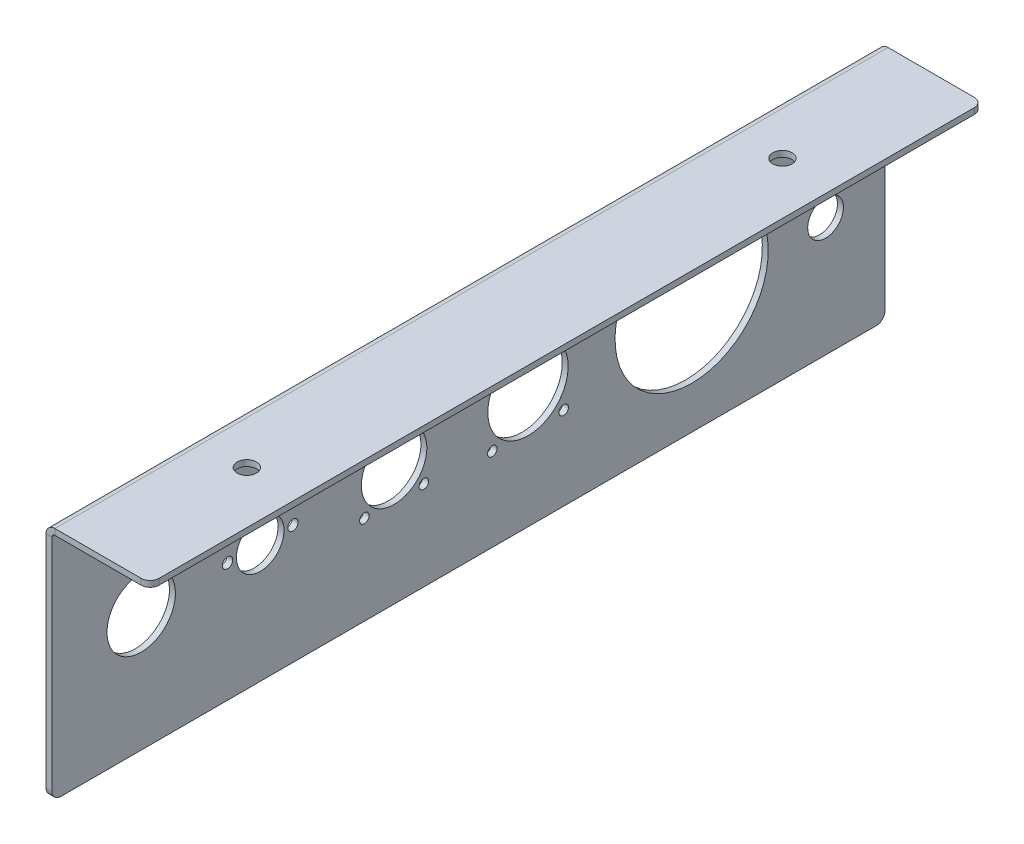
ISO-10303-21;
HEADER;
FILE_DESCRIPTION(('STEP AP214'),'2;1');
FILE_NAME('part.step','',(''),(''),'','','');
FILE_SCHEMA(('AUTOMOTIVE_DESIGN { 1 0 10303 214 1 1 1 1 }'));
ENDSEC;
DATA;
#1=APPLICATION_CONTEXT('core data for automotive mechanical design processes');
#2=APPLICATION_PROTOCOL_DEFINITION('international standard','automotive_design',2000,#1);
#3=PRODUCT_CONTEXT('',#1,'mechanical');
#4=PRODUCT('Part','Part','',(#3));
#5=PRODUCT_RELATED_PRODUCT_CATEGORY('part','',(#4));
#6=PRODUCT_DEFINITION_FORMATION('','',#4);
#7=PRODUCT_DEFINITION_CONTEXT('part definition',#1,'design');
#8=PRODUCT_DEFINITION('design','',#6,#7);
#9=PRODUCT_DEFINITION_SHAPE('','',#8);
#10=(LENGTH_UNIT() NAMED_UNIT(*) SI_UNIT(.MILLI.,.METRE.));
#11=(NAMED_UNIT(*) PLANE_ANGLE_UNIT() SI_UNIT($,.RADIAN.));
#12=(NAMED_UNIT(*) SI_UNIT($,.STERADIAN.) SOLID_ANGLE_UNIT());
#13=UNCERTAINTY_MEASURE_WITH_UNIT(LENGTH_MEASURE(1.E-05),#10,'distance_accuracy_value','');
#14=(GEOMETRIC_REPRESENTATION_CONTEXT(3) GLOBAL_UNCERTAINTY_ASSIGNED_CONTEXT((#13)) GLOBAL_UNIT_ASSIGNED_CONTEXT((#10,
#11,#12)) REPRESENTATION_CONTEXT('',''));
#15=CARTESIAN_POINT('',(0.,0.,0.));
#16=DIRECTION('',(0.,0.,1.));
#17=DIRECTION('',(1.,0.,0.));
#18=AXIS2_PLACEMENT_3D('',#15,#16,#17);
#19=CARTESIAN_POINT('',(17.5,-80.,90.));
#20=DIRECTION('',(0.,1.,0.));
#21=DIRECTION('',(0.,0.,1.));
#22=AXIS2_PLACEMENT_3D('',#19,#20,#21);
#23=CYLINDRICAL_SURFACE('',#22,3.25);
#24=CARTESIAN_POINT('',(17.5,-2.,90.));
#25=DIRECTION('',(0.,-1.,0.));
#26=DIRECTION('',(1.,0.,0.));
#27=AXIS2_PLACEMENT_3D('',#24,#25,#26);
#28=CIRCLE('',#27,3.25);
#29=CARTESIAN_POINT('',(20.75,-2.,90.));
#30=VERTEX_POINT('',#29);
#31=EDGE_CURVE('E240',#30,#30,#28,.T.);
#32=ORIENTED_EDGE('',*,*,#31,.T.);
#33=EDGE_LOOP('',(#32));
#34=FACE_BOUND('',#33,.T.);
#35=CARTESIAN_POINT('',(17.5,0.,90.));
#36=DIRECTION('',(0.,1.,0.));
#37=DIRECTION('',(0.,0.,1.));
#38=AXIS2_PLACEMENT_3D('',#35,#36,#37);
#39=CIRCLE('',#38,3.25);
#40=CARTESIAN_POINT('',(17.5,0.,93.25));
#41=VERTEX_POINT('',#40);
#42=EDGE_CURVE('E259',#41,#41,#39,.T.);
#43=ORIENTED_EDGE('',*,*,#42,.T.);
#44=EDGE_LOOP('',(#43));
#45=FACE_BOUND('',#44,.T.);
#46=ADVANCED_FACE('F28',(#34,#45),#23,.F.);
#47=CARTESIAN_POINT('',(0.,0.,140.));
#48=DIRECTION('',(0.,1.,0.));
#49=DIRECTION('',(0.,0.,1.));
#50=AXIS2_PLACEMENT_3D('',#47,#48,#49);
#51=PLANE('',#50);
#52=DIRECTION('',(0.,0.,-1.));
#53=VECTOR('',#52,1.);
#54=CARTESIAN_POINT('',(2.99999999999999,0.,-140.));
#55=LINE('',#54,#53);
#56=CARTESIAN_POINT('',(2.99999999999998,0.,140.));
#57=VERTEX_POINT('',#56);
#58=CARTESIAN_POINT('',(2.99999999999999,0.,-140.));
#59=VERTEX_POINT('',#58);
#60=EDGE_CURVE('E274',#57,#59,#55,.T.);
#61=ORIENTED_EDGE('',*,*,#60,.F.);
#62=DIRECTION('',(1.,0.,0.));
#63=VECTOR('',#62,1.);
#64=CARTESIAN_POINT('',(34.9999999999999,0.,140.));
#65=LINE('',#64,#63);
#66=CARTESIAN_POINT('',(32.,0.,140.));
#67=VERTEX_POINT('',#66);
#68=EDGE_CURVE('E11',#57,#67,#65,.T.);
#69=ORIENTED_EDGE('',*,*,#68,.T.);
#70=CARTESIAN_POINT('',(32.,0.,137.));
#71=DIRECTION('',(0.,1.,0.));
#72=DIRECTION('',(0.,0.,1.));
#73=AXIS2_PLACEMENT_3D('',#70,#71,#72);
#74=CIRCLE('',#73,3.);
#75=CARTESIAN_POINT('',(35.,0.,137.));
#76=VERTEX_POINT('',#75);
#77=EDGE_CURVE('E262',#67,#76,#74,.T.);
#78=ORIENTED_EDGE('',*,*,#77,.T.);
#79=DIRECTION('',(0.,0.,-1.));
#80=VECTOR('',#79,1.);
#81=CARTESIAN_POINT('',(35.,0.,140.));
#82=LINE('',#81,#80);
#83=CARTESIAN_POINT('',(35.,0.,-137.));
#84=VERTEX_POINT('',#83);
#85=EDGE_CURVE('E265',#76,#84,#82,.T.);
#86=ORIENTED_EDGE('',*,*,#85,.T.);
#87=CARTESIAN_POINT('',(32.,0.,-137.));
#88=DIRECTION('',(0.,1.,0.));
#89=DIRECTION('',(0.,0.,1.));
#90=AXIS2_PLACEMENT_3D('',#87,#88,#89);
#91=CIRCLE('',#90,3.);
#92=CARTESIAN_POINT('',(32.,0.,-140.));
#93=VERTEX_POINT('',#92);
#94=EDGE_CURVE('E268',#84,#93,#91,.T.);
#95=ORIENTED_EDGE('',*,*,#94,.T.);
#96=DIRECTION('',(1.,0.,0.));
#97=VECTOR('',#96,1.);
#98=CARTESIAN_POINT('',(0.,0.,-140.));
#99=LINE('',#98,#97);
#100=EDGE_CURVE('E51',#59,#93,#99,.T.);
#101=ORIENTED_EDGE('',*,*,#100,.F.);
#102=EDGE_LOOP('',(#61,#69,#78,#86,#95,#101));
#103=FACE_BOUND('',#102,.T.);
#104=CARTESIAN_POINT('',(17.5,0.,-90.));
#105=DIRECTION('',(0.,1.,0.));
#106=DIRECTION('',(0.,0.,1.));
#107=AXIS2_PLACEMENT_3D('',#104,#105,#106);
#108=CIRCLE('',#107,3.25);
#109=CARTESIAN_POINT('',(17.5,0.,-86.75));
#110=VERTEX_POINT('',#109);
#111=EDGE_CURVE('E256',#110,#110,#108,.T.);
#112=ORIENTED_EDGE('',*,*,#111,.F.);
#113=EDGE_LOOP('',(#112));
#114=FACE_BOUND('',#113,.T.);
#115=ORIENTED_EDGE('',*,*,#42,.F.);
#116=EDGE_LOOP('',(#115));
#117=FACE_BOUND('',#116,.T.);
#118=ADVANCED_FACE('F291',(#103,#114,#117),#51,.T.);
#119=CARTESIAN_POINT('',(17.5,-80.,-90.));
#120=DIRECTION('',(0.,1.,0.));
#121=DIRECTION('',(0.,0.,1.));
#122=AXIS2_PLACEMENT_3D('',#119,#120,#121);
#123=CYLINDRICAL_SURFACE('',#122,3.25);
#124=CARTESIAN_POINT('',(17.5,-2.,-90.));
#125=DIRECTION('',(0.,-1.,0.));
#126=DIRECTION('',(1.,0.,0.));
#127=AXIS2_PLACEMENT_3D('',#124,#125,#126);
#128=CIRCLE('',#127,3.25);
#129=CARTESIAN_POINT('',(20.75,-2.,-90.));
#130=VERTEX_POINT('',#129);
#131=EDGE_CURVE('E145',#130,#130,#128,.T.);
#132=ORIENTED_EDGE('',*,*,#131,.T.);
#133=EDGE_LOOP('',(#132));
#134=FACE_BOUND('',#133,.T.);
#135=ORIENTED_EDGE('',*,*,#111,.T.);
#136=EDGE_LOOP('',(#135));
#137=FACE_BOUND('',#136,.T.);
#138=ADVANCED_FACE('F391',(#134,#137),#123,.F.);
#139=CARTESIAN_POINT('',(35.,-2.,140.));
#140=DIRECTION('',(0.,-1.,0.));
#141=DIRECTION('',(1.,0.,0.));
#142=AXIS2_PLACEMENT_3D('',#139,#140,#141);
#143=PLANE('',#142);
#144=DIRECTION('',(0.,0.,1.));
#145=VECTOR('',#144,1.);
#146=CARTESIAN_POINT('',(2.99999999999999,-2.00000000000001,-140.));
#147=LINE('',#146,#145);
#148=CARTESIAN_POINT('',(2.99999999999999,-1.99999999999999,-140.));
#149=VERTEX_POINT('',#148);
#150=CARTESIAN_POINT('',(2.99999999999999,-1.99999999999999,140.));
#151=VERTEX_POINT('',#150);
#152=EDGE_CURVE('E272',#149,#151,#147,.T.);
#153=ORIENTED_EDGE('',*,*,#152,.F.);
#154=DIRECTION('',(-1.,0.,0.));
#155=VECTOR('',#154,1.);
#156=CARTESIAN_POINT('',(35.,-2.,-140.));
#157=LINE('',#156,#155);
#158=CARTESIAN_POINT('',(32.,-2.00000000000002,-140.));
#159=VERTEX_POINT('',#158);
#160=EDGE_CURVE('E251',#159,#149,#157,.T.);
#161=ORIENTED_EDGE('',*,*,#160,.F.);
#162=CARTESIAN_POINT('',(32.,-2.,-137.));
#163=DIRECTION('',(0.,-1.,0.));
#164=DIRECTION('',(1.,0.,0.));
#165=AXIS2_PLACEMENT_3D('',#162,#163,#164);
#166=CIRCLE('',#165,3.);
#167=CARTESIAN_POINT('',(35.,-2.00000000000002,-137.));
#168=VERTEX_POINT('',#167);
#169=EDGE_CURVE('E253',#159,#168,#166,.T.);
#170=ORIENTED_EDGE('',*,*,#169,.T.);
#171=DIRECTION('',(0.,0.,-1.));
#172=VECTOR('',#171,1.);
#173=CARTESIAN_POINT('',(35.,-2.,140.));
#174=LINE('',#173,#172);
#175=CARTESIAN_POINT('',(35.,-2.00000000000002,137.));
#176=VERTEX_POINT('',#175);
#177=EDGE_CURVE('E243',#176,#168,#174,.T.);
#178=ORIENTED_EDGE('',*,*,#177,.F.);
#179=CARTESIAN_POINT('',(32.,-2.,137.));
#180=DIRECTION('',(0.,-1.,0.));
#181=DIRECTION('',(1.,0.,0.));
#182=AXIS2_PLACEMENT_3D('',#179,#180,#181);
#183=CIRCLE('',#182,3.);
#184=CARTESIAN_POINT('',(32.,-2.00000000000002,140.));
#185=VERTEX_POINT('',#184);
#186=EDGE_CURVE('E245',#176,#185,#183,.T.);
#187=ORIENTED_EDGE('',*,*,#186,.T.);
#188=DIRECTION('',(-1.,0.,0.));
#189=VECTOR('',#188,1.);
#190=CARTESIAN_POINT('',(35.,-2.,140.));
#191=LINE('',#190,#189);
#192=EDGE_CURVE('E248',#185,#151,#191,.T.);
#193=ORIENTED_EDGE('',*,*,#192,.T.);
#194=EDGE_LOOP('',(#153,#161,#170,#178,#187,#193));
#195=FACE_BOUND('',#194,.T.);
#196=ORIENTED_EDGE('',*,*,#131,.F.);
#197=EDGE_LOOP('',(#196));
#198=FACE_BOUND('',#197,.T.);
#199=ORIENTED_EDGE('',*,*,#31,.F.);
#200=EDGE_LOOP('',(#199));
#201=FACE_BOUND('',#200,.T.);
#202=ADVANCED_FACE('F301',(#195,#198,#201),#143,.T.);
#203=CARTESIAN_POINT('',(34.9999999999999,-563.645278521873,-140.));
#204=DIRECTION('',(0.,0.,-1.));
#205=DIRECTION('',(0.,1.,0.));
#206=AXIS2_PLACEMENT_3D('',#203,#204,#205);
#207=PLANE('',#206);
#208=DIRECTION('',(0.,1.,0.));
#209=VECTOR('',#208,1.);
#210=CARTESIAN_POINT('',(2.99999999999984,-563.645278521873,-140.));
#211=LINE('',#210,#209);
#212=EDGE_CURVE('E36',#149,#59,#211,.T.);
#213=ORIENTED_EDGE('',*,*,#212,.T.);
#214=ORIENTED_EDGE('',*,*,#100,.T.);
#215=DIRECTION('',(0.,1.,0.));
#216=VECTOR('',#215,1.);
#217=CARTESIAN_POINT('',(31.9999999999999,-563.645278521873,-140.));
#218=LINE('',#217,#216);
#219=EDGE_CURVE('E286',#159,#93,#218,.T.);
#220=ORIENTED_EDGE('',*,*,#219,.F.);
#221=ORIENTED_EDGE('',*,*,#160,.T.);
#222=EDGE_LOOP('',(#213,#214,#220,#221));
#223=FACE_BOUND('',#222,.T.);
#224=ADVANCED_FACE('F30',(#223),#207,.T.);
#225=CARTESIAN_POINT('',(31.9999999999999,-563.645278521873,-137.));
#226=DIRECTION('',(0.,1.,0.));
#227=DIRECTION('',(-1.,0.,0.));
#228=AXIS2_PLACEMENT_3D('',#225,#226,#227);
#229=CYLINDRICAL_SURFACE('',#228,3.);
#230=ORIENTED_EDGE('',*,*,#94,.F.);
#231=DIRECTION('',(0.,1.,0.));
#232=VECTOR('',#231,1.);
#233=CARTESIAN_POINT('',(34.9999999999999,-563.645278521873,-137.));
#234=LINE('',#233,#232);
#235=EDGE_CURVE('E283',#168,#84,#234,.T.);
#236=ORIENTED_EDGE('',*,*,#235,.F.);
#237=ORIENTED_EDGE('',*,*,#169,.F.);
#238=ORIENTED_EDGE('',*,*,#219,.T.);
#239=EDGE_LOOP('',(#230,#236,#237,#238));
#240=FACE_BOUND('',#239,.T.);
#241=ADVANCED_FACE('F295',(#240),#229,.T.);
#242=CARTESIAN_POINT('',(34.9999999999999,-563.645278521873,140.));
#243=DIRECTION('',(1.,0.,0.));
#244=DIRECTION('',(0.,1.,0.));
#245=AXIS2_PLACEMENT_3D('',#242,#243,#244);
#246=PLANE('',#245);
#247=ORIENTED_EDGE('',*,*,#235,.T.);
#248=ORIENTED_EDGE('',*,*,#85,.F.);
#249=DIRECTION('',(0.,1.,0.));
#250=VECTOR('',#249,1.);
#251=CARTESIAN_POINT('',(34.9999999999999,-563.645278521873,137.));
#252=LINE('',#251,#250);
#253=EDGE_CURVE('E280',#176,#76,#252,.T.);
#254=ORIENTED_EDGE('',*,*,#253,.F.);
#255=ORIENTED_EDGE('',*,*,#177,.T.);
#256=EDGE_LOOP('',(#247,#248,#254,#255));
#257=FACE_BOUND('',#256,.T.);
#258=ADVANCED_FACE('F297',(#257),#246,.T.);
#259=CARTESIAN_POINT('',(31.9999999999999,-563.645278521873,137.));
#260=DIRECTION('',(0.,1.,0.));
#261=DIRECTION('',(-1.,0.,0.));
#262=AXIS2_PLACEMENT_3D('',#259,#260,#261);
#263=CYLINDRICAL_SURFACE('',#262,3.);
#264=ORIENTED_EDGE('',*,*,#77,.F.);
#265=DIRECTION('',(0.,1.,0.));
#266=VECTOR('',#265,1.);
#267=CARTESIAN_POINT('',(31.9999999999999,-563.645278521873,140.));
#268=LINE('',#267,#266);
#269=EDGE_CURVE('E278',#185,#67,#268,.T.);
#270=ORIENTED_EDGE('',*,*,#269,.F.);
#271=ORIENTED_EDGE('',*,*,#186,.F.);
#272=ORIENTED_EDGE('',*,*,#253,.T.);
#273=EDGE_LOOP('',(#264,#270,#271,#272));
#274=FACE_BOUND('',#273,.T.);
#275=ADVANCED_FACE('F381',(#274),#263,.T.);
#276=CARTESIAN_POINT('',(34.9999999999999,-563.645278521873,140.));
#277=DIRECTION('',(0.,0.,-1.));
#278=DIRECTION('',(0.,1.,0.));
#279=AXIS2_PLACEMENT_3D('',#276,#277,#278);
#280=PLANE('',#279);
#281=ORIENTED_EDGE('',*,*,#68,.F.);
#282=DIRECTION('',(0.,1.,0.));
#283=VECTOR('',#282,1.);
#284=CARTESIAN_POINT('',(2.99999999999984,-563.645278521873,140.));
#285=LINE('',#284,#283);
#286=EDGE_CURVE('E276',#151,#57,#285,.T.);
#287=ORIENTED_EDGE('',*,*,#286,.F.);
#288=ORIENTED_EDGE('',*,*,#192,.F.);
#289=ORIENTED_EDGE('',*,*,#269,.T.);
#290=EDGE_LOOP('',(#281,#287,#288,#289));
#291=FACE_BOUND('',#290,.T.);
#292=ADVANCED_FACE('F377',(#291),#280,.F.);
#293=CARTESIAN_POINT('',(0.,0.,140.));
#294=DIRECTION('',(1.,0.,0.));
#295=DIRECTION('',(0.,1.,0.));
#296=AXIS2_PLACEMENT_3D('',#293,#294,#295);
#297=PLANE('',#296);
#298=CARTESIAN_POINT('',(0.,-40.,-20.));
#299=DIRECTION('',(1.,0.,0.));
#300=DIRECTION('',(0.,1.,0.));
#301=AXIS2_PLACEMENT_3D('',#298,#299,#300);
#302=CIRCLE('',#301,13.5);
#303=CARTESIAN_POINT('',(0.,-26.5,-20.));
#304=VERTEX_POINT('',#303);
#305=EDGE_CURVE('E135',#304,#304,#302,.T.);
#306=ORIENTED_EDGE('',*,*,#305,.T.);
#307=EDGE_LOOP('',(#306));
#308=FACE_BOUND('',#307,.T.);
#309=CARTESIAN_POINT('',(0.,-28.,-32.));
#310=DIRECTION('',(1.,0.,0.));
#311=DIRECTION('',(0.,1.,0.));
#312=AXIS2_PLACEMENT_3D('',#309,#310,#311);
#313=CIRCLE('',#312,1.6);
#314=CARTESIAN_POINT('',(0.,-26.4,-32.));
#315=VERTEX_POINT('',#314);
#316=EDGE_CURVE('E218',#315,#315,#313,.T.);
#317=ORIENTED_EDGE('',*,*,#316,.T.);
#318=EDGE_LOOP('',(#317));
#319=FACE_BOUND('',#318,.T.);
#320=CARTESIAN_POINT('',(0.,-52.,-7.99999999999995));
#321=DIRECTION('',(1.,0.,0.));
#322=DIRECTION('',(0.,1.,0.));
#323=AXIS2_PLACEMENT_3D('',#320,#321,#322);
#324=CIRCLE('',#323,1.59999999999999);
#325=CARTESIAN_POINT('',(0.,-50.4,-7.99999999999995));
#326=VERTEX_POINT('',#325);
#327=EDGE_CURVE('E215',#326,#326,#324,.T.);
#328=ORIENTED_EDGE('',*,*,#327,.T.);
#329=EDGE_LOOP('',(#328));
#330=FACE_BOUND('',#329,.T.);
#331=CARTESIAN_POINT('',(0.,-40.,-120.));
#332=DIRECTION('',(-1.,0.,0.));
#333=DIRECTION('',(0.,-1.,0.));
#334=AXIS2_PLACEMENT_3D('',#331,#332,#333);
#335=CIRCLE('',#334,6.);
#336=CARTESIAN_POINT('',(0.,-46.,-120.));
#337=VERTEX_POINT('',#336);
#338=EDGE_CURVE('E201',#337,#337,#335,.T.);
#339=ORIENTED_EDGE('',*,*,#338,.F.);
#340=EDGE_LOOP('',(#339));
#341=FACE_BOUND('',#340,.T.);
#342=CARTESIAN_POINT('',(0.,-40.,-75.));
#343=DIRECTION('',(-1.,0.,0.));
#344=DIRECTION('',(0.,-1.,0.));
#345=AXIS2_PLACEMENT_3D('',#342,#343,#344);
#346=CIRCLE('',#345,25.75);
#347=CARTESIAN_POINT('',(0.,-65.75,-75.));
#348=VERTEX_POINT('',#347);
#349=EDGE_CURVE('E198',#348,#348,#346,.T.);
#350=ORIENTED_EDGE('',*,*,#349,.F.);
#351=EDGE_LOOP('',(#350));
#352=FACE_BOUND('',#351,.T.);
#353=CARTESIAN_POINT('',(0.,-40.,110.));
#354=DIRECTION('',(-1.,0.,0.));
#355=DIRECTION('',(0.,-1.,0.));
#356=AXIS2_PLACEMENT_3D('',#353,#354,#355);
#357=CIRCLE('',#356,11.5);
#358=CARTESIAN_POINT('',(0.,-51.5,110.));
#359=VERTEX_POINT('',#358);
#360=EDGE_CURVE('E195',#359,#359,#357,.T.);
#361=ORIENTED_EDGE('',*,*,#360,.F.);
#362=EDGE_LOOP('',(#361));
#363=FACE_BOUND('',#362,.T.);
#364=CARTESIAN_POINT('',(0.,-40.,81.));
#365=DIRECTION('',(-1.,0.,0.));
#366=DIRECTION('',(0.,-1.,0.));
#367=AXIS2_PLACEMENT_3D('',#364,#365,#366);
#368=CIRCLE('',#367,1.75);
#369=CARTESIAN_POINT('',(0.,-41.75,81.));
#370=VERTEX_POINT('',#369);
#371=EDGE_CURVE('E192',#370,#370,#368,.T.);
#372=ORIENTED_EDGE('',*,*,#371,.F.);
#373=EDGE_LOOP('',(#372));
#374=FACE_BOUND('',#373,.T.);
#375=CARTESIAN_POINT('',(0.,-40.,59.));
#376=DIRECTION('',(1.,0.,0.));
#377=DIRECTION('',(0.,1.,0.));
#378=AXIS2_PLACEMENT_3D('',#375,#376,#377);
#379=CIRCLE('',#378,1.75);
#380=CARTESIAN_POINT('',(0.,-38.25,59.));
#381=VERTEX_POINT('',#380);
#382=EDGE_CURVE('E189',#381,#381,#379,.T.);
#383=ORIENTED_EDGE('',*,*,#382,.T.);
#384=EDGE_LOOP('',(#383));
#385=FACE_BOUND('',#384,.T.);
#386=CARTESIAN_POINT('',(0.,-28.,-7.99999999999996));
#387=DIRECTION('',(1.,0.,0.));
#388=DIRECTION('',(0.,1.,0.));
#389=AXIS2_PLACEMENT_3D('',#386,#387,#388);
#390=CIRCLE('',#389,1.6);
#391=CARTESIAN_POINT('',(0.,-26.4,-7.99999999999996));
#392=VERTEX_POINT('',#391);
#393=EDGE_CURVE('E186',#392,#392,#390,.T.);
#394=ORIENTED_EDGE('',*,*,#393,.T.);
#395=EDGE_LOOP('',(#394));
#396=FACE_BOUND('',#395,.T.);
#397=CARTESIAN_POINT('',(0.,-52.,-32.));
#398=DIRECTION('',(1.,0.,0.));
#399=DIRECTION('',(0.,1.,0.));
#400=AXIS2_PLACEMENT_3D('',#397,#398,#399);
#401=CIRCLE('',#400,1.60000000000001);
#402=CARTESIAN_POINT('',(0.,-50.4,-32.));
#403=VERTEX_POINT('',#402);
#404=EDGE_CURVE('E183',#403,#403,#401,.T.);
#405=ORIENTED_EDGE('',*,*,#404,.T.);
#406=EDGE_LOOP('',(#405));
#407=FACE_BOUND('',#406,.T.);
#408=CARTESIAN_POINT('',(0.,-40.,25.));
#409=DIRECTION('',(-1.,0.,0.));
#410=DIRECTION('',(0.,-1.,0.));
#411=AXIS2_PLACEMENT_3D('',#408,#409,#410);
#412=CIRCLE('',#411,11.);
#413=CARTESIAN_POINT('',(0.,-51.,25.));
#414=VERTEX_POINT('',#413);
#415=EDGE_CURVE('E180',#414,#414,#412,.T.);
#416=ORIENTED_EDGE('',*,*,#415,.F.);
#417=EDGE_LOOP('',(#416));
#418=FACE_BOUND('',#417,.T.);
#419=CARTESIAN_POINT('',(0.,-50.,35.));
#420=DIRECTION('',(-1.,0.,0.));
#421=DIRECTION('',(0.,-1.,0.));
#422=AXIS2_PLACEMENT_3D('',#419,#420,#421);
#423=CIRCLE('',#422,1.6);
#424=CARTESIAN_POINT('',(0.,-51.6,35.));
#425=VERTEX_POINT('',#424);
#426=EDGE_CURVE('E177',#425,#425,#423,.T.);
#427=ORIENTED_EDGE('',*,*,#426,.F.);
#428=EDGE_LOOP('',(#427));
#429=FACE_BOUND('',#428,.T.);
#430=CARTESIAN_POINT('',(0.,-50.,15.));
#431=DIRECTION('',(-1.,0.,0.));
#432=DIRECTION('',(0.,-1.,0.));
#433=AXIS2_PLACEMENT_3D('',#430,#431,#432);
#434=CIRCLE('',#433,1.6);
#435=CARTESIAN_POINT('',(0.,-51.6,15.));
#436=VERTEX_POINT('',#435);
#437=EDGE_CURVE('E174',#436,#436,#434,.T.);
#438=ORIENTED_EDGE('',*,*,#437,.F.);
#439=EDGE_LOOP('',(#438));
#440=FACE_BOUND('',#439,.T.);
#441=CARTESIAN_POINT('',(0.,-30.,15.));
#442=DIRECTION('',(-1.,0.,0.));
#443=DIRECTION('',(0.,-1.,0.));
#444=AXIS2_PLACEMENT_3D('',#441,#442,#443);
#445=CIRCLE('',#444,1.6);
#446=CARTESIAN_POINT('',(0.,-31.6,15.));
#447=VERTEX_POINT('',#446);
#448=EDGE_CURVE('E171',#447,#447,#445,.T.);
#449=ORIENTED_EDGE('',*,*,#448,.F.);
#450=EDGE_LOOP('',(#449));
#451=FACE_BOUND('',#450,.T.);
#452=CARTESIAN_POINT('',(0.,-30.,35.));
#453=DIRECTION('',(-1.,0.,0.));
#454=DIRECTION('',(0.,-1.,0.));
#455=AXIS2_PLACEMENT_3D('',#452,#453,#454);
#456=CIRCLE('',#455,1.6);
#457=CARTESIAN_POINT('',(0.,-31.6,35.));
#458=VERTEX_POINT('',#457);
#459=EDGE_CURVE('E168',#458,#458,#456,.T.);
#460=ORIENTED_EDGE('',*,*,#459,.F.);
#461=EDGE_LOOP('',(#460));
#462=FACE_BOUND('',#461,.T.);
#463=CARTESIAN_POINT('',(0.,-40.,70.));
#464=DIRECTION('',(-1.,0.,0.));
#465=DIRECTION('',(0.,-1.,0.));
#466=AXIS2_PLACEMENT_3D('',#463,#464,#465);
#467=CIRCLE('',#466,8.);
#468=CARTESIAN_POINT('',(0.,-48.,70.));
#469=VERTEX_POINT('',#468);
#470=EDGE_CURVE('E165',#469,#469,#467,.T.);
#471=ORIENTED_EDGE('',*,*,#470,.F.);
#472=EDGE_LOOP('',(#471));
#473=FACE_BOUND('',#472,.T.);
#474=DIRECTION('',(0.,0.,1.));
#475=VECTOR('',#474,1.);
#476=CARTESIAN_POINT('',(0.,-2.99999999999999,-140.));
#477=LINE('',#476,#475);
#478=CARTESIAN_POINT('',(0.,-2.99999999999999,-140.));
#479=VERTEX_POINT('',#478);
#480=CARTESIAN_POINT('',(0.,-2.99999999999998,140.));
#481=VERTEX_POINT('',#480);
#482=EDGE_CURVE('E134',#479,#481,#477,.T.);
#483=ORIENTED_EDGE('',*,*,#482,.F.);
#484=DIRECTION('',(0.,-1.,0.));
#485=VECTOR('',#484,1.);
#486=CARTESIAN_POINT('',(0.,0.,-140.));
#487=LINE('',#486,#485);
#488=CARTESIAN_POINT('',(0.,-77.,-140.));
#489=VERTEX_POINT('',#488);
#490=EDGE_CURVE('E144',#479,#489,#487,.T.);
#491=ORIENTED_EDGE('',*,*,#490,.T.);
#492=CARTESIAN_POINT('',(0.,-77.,-137.));
#493=DIRECTION('',(1.,0.,0.));
#494=DIRECTION('',(0.,1.,0.));
#495=AXIS2_PLACEMENT_3D('',#492,#493,#494);
#496=CIRCLE('',#495,3.);
#497=CARTESIAN_POINT('',(0.,-80.,-137.));
#498=VERTEX_POINT('',#497);
#499=EDGE_CURVE('E213',#489,#498,#496,.F.);
#500=ORIENTED_EDGE('',*,*,#499,.T.);
#501=DIRECTION('',(0.,0.,-1.));
#502=VECTOR('',#501,1.);
#503=CARTESIAN_POINT('',(0.,-80.,140.));
#504=LINE('',#503,#502);
#505=CARTESIAN_POINT('',(0.,-80.,137.));
#506=VERTEX_POINT('',#505);
#507=EDGE_CURVE('E204',#506,#498,#504,.T.);
#508=ORIENTED_EDGE('',*,*,#507,.F.);
#509=CARTESIAN_POINT('',(0.,-77.,137.));
#510=DIRECTION('',(1.,0.,0.));
#511=DIRECTION('',(0.,1.,0.));
#512=AXIS2_PLACEMENT_3D('',#509,#510,#511);
#513=CIRCLE('',#512,3.);
#514=CARTESIAN_POINT('',(0.,-77.,140.));
#515=VERTEX_POINT('',#514);
#516=EDGE_CURVE('E207',#506,#515,#513,.F.);
#517=ORIENTED_EDGE('',*,*,#516,.T.);
#518=DIRECTION('',(0.,-1.,0.));
#519=VECTOR('',#518,1.);
#520=CARTESIAN_POINT('',(0.,0.,140.));
#521=LINE('',#520,#519);
#522=EDGE_CURVE('E209',#481,#515,#521,.T.);
#523=ORIENTED_EDGE('',*,*,#522,.F.);
#524=EDGE_LOOP('',(#483,#491,#500,#508,#517,#523));
#525=FACE_BOUND('',#524,.T.);
#526=ADVANCED_FACE('F366',(#308,#319,#330,#341,#352,#363,#374,#385,#396,#407,#418,#429,#440,
#451,#462,#473,#525),#297,.F.);
#527=CARTESIAN_POINT('',(1.99999999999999,-80.,140.));
#528=DIRECTION('',(-1.,0.,0.));
#529=DIRECTION('',(0.,-1.,0.));
#530=AXIS2_PLACEMENT_3D('',#527,#528,#529);
#531=PLANE('',#530);
#532=CARTESIAN_POINT('',(1.99999999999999,-40.,-20.));
#533=DIRECTION('',(-1.,0.,0.));
#534=DIRECTION('',(0.,-1.,0.));
#535=AXIS2_PLACEMENT_3D('',#532,#533,#534);
#536=CIRCLE('',#535,13.5);
#537=CARTESIAN_POINT('',(1.99999999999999,-53.5,-20.));
#538=VERTEX_POINT('',#537);
#539=EDGE_CURVE('E162',#538,#538,#536,.F.);
#540=ORIENTED_EDGE('',*,*,#539,.F.);
#541=EDGE_LOOP('',(#540));
#542=FACE_BOUND('',#541,.T.);
#543=CARTESIAN_POINT('',(1.99999999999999,-28.,-32.));
#544=DIRECTION('',(-1.,0.,0.));
#545=DIRECTION('',(0.,-1.,0.));
#546=AXIS2_PLACEMENT_3D('',#543,#544,#545);
#547=CIRCLE('',#546,1.6);
#548=CARTESIAN_POINT('',(1.99999999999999,-29.6,-32.));
#549=VERTEX_POINT('',#548);
#550=EDGE_CURVE('E154',#549,#549,#547,.F.);
#551=ORIENTED_EDGE('',*,*,#550,.F.);
#552=EDGE_LOOP('',(#551));
#553=FACE_BOUND('',#552,.T.);
#554=CARTESIAN_POINT('',(1.99999999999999,-52.,-7.99999999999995));
#555=DIRECTION('',(-1.,0.,0.));
#556=DIRECTION('',(0.,-1.,0.));
#557=AXIS2_PLACEMENT_3D('',#554,#555,#556);
#558=CIRCLE('',#557,1.59999999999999);
#559=CARTESIAN_POINT('',(1.99999999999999,-53.6,-7.99999999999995));
#560=VERTEX_POINT('',#559);
#561=EDGE_CURVE('E151',#560,#560,#558,.F.);
#562=ORIENTED_EDGE('',*,*,#561,.F.);
#563=EDGE_LOOP('',(#562));
#564=FACE_BOUND('',#563,.T.);
#565=CARTESIAN_POINT('',(1.99999999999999,-40.,-120.));
#566=DIRECTION('',(-1.,0.,0.));
#567=DIRECTION('',(0.,-1.,0.));
#568=AXIS2_PLACEMENT_3D('',#565,#566,#567);
#569=CIRCLE('',#568,6.);
#570=CARTESIAN_POINT('',(1.99999999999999,-46.,-120.));
#571=VERTEX_POINT('',#570);
#572=EDGE_CURVE('E348',#571,#571,#569,.T.);
#573=ORIENTED_EDGE('',*,*,#572,.T.);
#574=EDGE_LOOP('',(#573));
#575=FACE_BOUND('',#574,.T.);
#576=CARTESIAN_POINT('',(1.99999999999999,-40.,-75.));
#577=DIRECTION('',(-1.,0.,0.));
#578=DIRECTION('',(0.,-1.,0.));
#579=AXIS2_PLACEMENT_3D('',#576,#577,#578);
#580=CIRCLE('',#579,25.75);
#581=CARTESIAN_POINT('',(1.99999999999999,-65.75,-75.));
#582=VERTEX_POINT('',#581);
#583=EDGE_CURVE('E345',#582,#582,#580,.T.);
#584=ORIENTED_EDGE('',*,*,#583,.T.);
#585=EDGE_LOOP('',(#584));
#586=FACE_BOUND('',#585,.T.);
#587=CARTESIAN_POINT('',(1.99999999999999,-40.,110.));
#588=DIRECTION('',(-1.,0.,0.));
#589=DIRECTION('',(0.,-1.,0.));
#590=AXIS2_PLACEMENT_3D('',#587,#588,#589);
#591=CIRCLE('',#590,11.5);
#592=CARTESIAN_POINT('',(1.99999999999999,-51.5,110.));
#593=VERTEX_POINT('',#592);
#594=EDGE_CURVE('E342',#593,#593,#591,.T.);
#595=ORIENTED_EDGE('',*,*,#594,.T.);
#596=EDGE_LOOP('',(#595));
#597=FACE_BOUND('',#596,.T.);
#598=CARTESIAN_POINT('',(1.99999999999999,-40.,81.));
#599=DIRECTION('',(-1.,0.,0.));
#600=DIRECTION('',(0.,-1.,0.));
#601=AXIS2_PLACEMENT_3D('',#598,#599,#600);
#602=CIRCLE('',#601,1.75);
#603=CARTESIAN_POINT('',(1.99999999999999,-41.75,81.));
#604=VERTEX_POINT('',#603);
#605=EDGE_CURVE('E339',#604,#604,#602,.T.);
#606=ORIENTED_EDGE('',*,*,#605,.T.);
#607=EDGE_LOOP('',(#606));
#608=FACE_BOUND('',#607,.T.);
#609=CARTESIAN_POINT('',(1.99999999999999,-40.,59.));
#610=DIRECTION('',(-1.,0.,0.));
#611=DIRECTION('',(0.,-1.,0.));
#612=AXIS2_PLACEMENT_3D('',#609,#610,#611);
#613=CIRCLE('',#612,1.75);
#614=CARTESIAN_POINT('',(1.99999999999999,-41.75,59.));
#615=VERTEX_POINT('',#614);
#616=EDGE_CURVE('E336',#615,#615,#613,.F.);
#617=ORIENTED_EDGE('',*,*,#616,.F.);
#618=EDGE_LOOP('',(#617));
#619=FACE_BOUND('',#618,.T.);
#620=CARTESIAN_POINT('',(1.99999999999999,-28.,-7.99999999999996));
#621=DIRECTION('',(-1.,0.,0.));
#622=DIRECTION('',(0.,-1.,0.));
#623=AXIS2_PLACEMENT_3D('',#620,#621,#622);
#624=CIRCLE('',#623,1.6);
#625=CARTESIAN_POINT('',(1.99999999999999,-29.6,-7.99999999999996));
#626=VERTEX_POINT('',#625);
#627=EDGE_CURVE('E333',#626,#626,#624,.F.);
#628=ORIENTED_EDGE('',*,*,#627,.F.);
#629=EDGE_LOOP('',(#628));
#630=FACE_BOUND('',#629,.T.);
#631=CARTESIAN_POINT('',(1.99999999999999,-52.,-32.));
#632=DIRECTION('',(-1.,0.,0.));
#633=DIRECTION('',(0.,-1.,0.));
#634=AXIS2_PLACEMENT_3D('',#631,#632,#633);
#635=CIRCLE('',#634,1.60000000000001);
#636=CARTESIAN_POINT('',(1.99999999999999,-53.6,-32.));
#637=VERTEX_POINT('',#636);
#638=EDGE_CURVE('E330',#637,#637,#635,.F.);
#639=ORIENTED_EDGE('',*,*,#638,.F.);
#640=EDGE_LOOP('',(#639));
#641=FACE_BOUND('',#640,.T.);
#642=CARTESIAN_POINT('',(1.99999999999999,-40.,25.));
#643=DIRECTION('',(-1.,0.,0.));
#644=DIRECTION('',(0.,-1.,0.));
#645=AXIS2_PLACEMENT_3D('',#642,#643,#644);
#646=CIRCLE('',#645,11.);
#647=CARTESIAN_POINT('',(1.99999999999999,-51.,25.));
#648=VERTEX_POINT('',#647);
#649=EDGE_CURVE('E327',#648,#648,#646,.T.);
#650=ORIENTED_EDGE('',*,*,#649,.T.);
#651=EDGE_LOOP('',(#650));
#652=FACE_BOUND('',#651,.T.);
#653=CARTESIAN_POINT('',(1.99999999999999,-50.,35.));
#654=DIRECTION('',(-1.,0.,0.));
#655=DIRECTION('',(0.,-1.,0.));
#656=AXIS2_PLACEMENT_3D('',#653,#654,#655);
#657=CIRCLE('',#656,1.6);
#658=CARTESIAN_POINT('',(1.99999999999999,-51.6,35.));
#659=VERTEX_POINT('',#658);
#660=EDGE_CURVE('E324',#659,#659,#657,.T.);
#661=ORIENTED_EDGE('',*,*,#660,.T.);
#662=EDGE_LOOP('',(#661));
#663=FACE_BOUND('',#662,.T.);
#664=CARTESIAN_POINT('',(1.99999999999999,-50.,15.));
#665=DIRECTION('',(-1.,0.,0.));
#666=DIRECTION('',(0.,-1.,0.));
#667=AXIS2_PLACEMENT_3D('',#664,#665,#666);
#668=CIRCLE('',#667,1.6);
#669=CARTESIAN_POINT('',(1.99999999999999,-51.6,15.));
#670=VERTEX_POINT('',#669);
#671=EDGE_CURVE('E321',#670,#670,#668,.T.);
#672=ORIENTED_EDGE('',*,*,#671,.T.);
#673=EDGE_LOOP('',(#672));
#674=FACE_BOUND('',#673,.T.);
#675=CARTESIAN_POINT('',(1.99999999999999,-30.,15.));
#676=DIRECTION('',(-1.,0.,0.));
#677=DIRECTION('',(0.,-1.,0.));
#678=AXIS2_PLACEMENT_3D('',#675,#676,#677);
#679=CIRCLE('',#678,1.6);
#680=CARTESIAN_POINT('',(1.99999999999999,-31.6,15.));
#681=VERTEX_POINT('',#680);
#682=EDGE_CURVE('E318',#681,#681,#679,.T.);
#683=ORIENTED_EDGE('',*,*,#682,.T.);
#684=EDGE_LOOP('',(#683));
#685=FACE_BOUND('',#684,.T.);
#686=CARTESIAN_POINT('',(1.99999999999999,-30.,35.));
#687=DIRECTION('',(-1.,0.,0.));
#688=DIRECTION('',(0.,-1.,0.));
#689=AXIS2_PLACEMENT_3D('',#686,#687,#688);
#690=CIRCLE('',#689,1.6);
#691=CARTESIAN_POINT('',(1.99999999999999,-31.6,35.));
#692=VERTEX_POINT('',#691);
#693=EDGE_CURVE('E315',#692,#692,#690,.T.);
#694=ORIENTED_EDGE('',*,*,#693,.T.);
#695=EDGE_LOOP('',(#694));
#696=FACE_BOUND('',#695,.T.);
#697=CARTESIAN_POINT('',(1.99999999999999,-40.,70.));
#698=DIRECTION('',(-1.,0.,0.));
#699=DIRECTION('',(0.,-1.,0.));
#700=AXIS2_PLACEMENT_3D('',#697,#698,#699);
#701=CIRCLE('',#700,8.);
#702=CARTESIAN_POINT('',(1.99999999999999,-48.,70.));
#703=VERTEX_POINT('',#702);
#704=EDGE_CURVE('E312',#703,#703,#701,.T.);
#705=ORIENTED_EDGE('',*,*,#704,.T.);
#706=EDGE_LOOP('',(#705));
#707=FACE_BOUND('',#706,.T.);
#708=DIRECTION('',(0.,0.,-1.));
#709=VECTOR('',#708,1.);
#710=CARTESIAN_POINT('',(2.,-2.99999999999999,-140.));
#711=LINE('',#710,#709);
#712=CARTESIAN_POINT('',(1.99999999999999,-2.99999999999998,140.));
#713=VERTEX_POINT('',#712);
#714=CARTESIAN_POINT('',(1.99999999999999,-2.99999999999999,-140.));
#715=VERTEX_POINT('',#714);
#716=EDGE_CURVE('E128',#713,#715,#711,.T.);
#717=ORIENTED_EDGE('',*,*,#716,.F.);
#718=DIRECTION('',(0.,1.,0.));
#719=VECTOR('',#718,1.);
#720=CARTESIAN_POINT('',(1.99999999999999,-80.,140.));
#721=LINE('',#720,#719);
#722=CARTESIAN_POINT('',(1.99999999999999,-77.,140.));
#723=VERTEX_POINT('',#722);
#724=EDGE_CURVE('E351',#723,#713,#721,.T.);
#725=ORIENTED_EDGE('',*,*,#724,.F.);
#726=CARTESIAN_POINT('',(1.99999999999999,-77.,137.));
#727=DIRECTION('',(-1.,0.,0.));
#728=DIRECTION('',(0.,-1.,0.));
#729=AXIS2_PLACEMENT_3D('',#726,#727,#728);
#730=CIRCLE('',#729,3.);
#731=CARTESIAN_POINT('',(1.99999999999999,-80.,137.));
#732=VERTEX_POINT('',#731);
#733=EDGE_CURVE('E353',#723,#732,#730,.F.);
#734=ORIENTED_EDGE('',*,*,#733,.T.);
#735=DIRECTION('',(0.,0.,-1.));
#736=VECTOR('',#735,1.);
#737=CARTESIAN_POINT('',(1.99999999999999,-80.,140.));
#738=LINE('',#737,#736);
#739=CARTESIAN_POINT('',(2.,-80.,-137.));
#740=VERTEX_POINT('',#739);
#741=EDGE_CURVE('E156',#732,#740,#738,.T.);
#742=ORIENTED_EDGE('',*,*,#741,.T.);
#743=CARTESIAN_POINT('',(1.99999999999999,-77.,-137.));
#744=DIRECTION('',(-1.,0.,0.));
#745=DIRECTION('',(0.,-1.,0.));
#746=AXIS2_PLACEMENT_3D('',#743,#744,#745);
#747=CIRCLE('',#746,3.);
#748=CARTESIAN_POINT('',(1.99999999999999,-77.,-140.));
#749=VERTEX_POINT('',#748);
#750=EDGE_CURVE('E150',#740,#749,#747,.F.);
#751=ORIENTED_EDGE('',*,*,#750,.T.);
#752=DIRECTION('',(0.,1.,0.));
#753=VECTOR('',#752,1.);
#754=CARTESIAN_POINT('',(1.99999999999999,-80.,-140.));
#755=LINE('',#754,#753);
#756=EDGE_CURVE('E142',#749,#715,#755,.T.);
#757=ORIENTED_EDGE('',*,*,#756,.T.);
#758=EDGE_LOOP('',(#717,#725,#734,#742,#751,#757));
#759=FACE_BOUND('',#758,.T.);
#760=ADVANCED_FACE('F148',(#542,#553,#564,#575,#586,#597,#608,#619,#630,#641,#652,#663,#674,
#685,#696,#707,#759),#531,.F.);
#761=CARTESIAN_POINT('',(35.,-40.,-20.));
#762=DIRECTION('',(-1.,0.,0.));
#763=DIRECTION('',(0.,-1.,0.));
#764=AXIS2_PLACEMENT_3D('',#761,#762,#763);
#765=CYLINDRICAL_SURFACE('',#764,13.5);
#766=ORIENTED_EDGE('',*,*,#305,.F.);
#767=EDGE_LOOP('',(#766));
#768=FACE_BOUND('',#767,.T.);
#769=ORIENTED_EDGE('',*,*,#539,.T.);
#770=EDGE_LOOP('',(#769));
#771=FACE_BOUND('',#770,.T.);
#772=ADVANCED_FACE('F454',(#768,#771),#765,.F.);
#773=CARTESIAN_POINT('',(35.,-28.,-32.));
#774=DIRECTION('',(-1.,0.,0.));
#775=DIRECTION('',(0.,-1.,0.));
#776=AXIS2_PLACEMENT_3D('',#773,#774,#775);
#777=CYLINDRICAL_SURFACE('',#776,1.6);
#778=ORIENTED_EDGE('',*,*,#316,.F.);
#779=EDGE_LOOP('',(#778));
#780=FACE_BOUND('',#779,.T.);
#781=ORIENTED_EDGE('',*,*,#550,.T.);
#782=EDGE_LOOP('',(#781));
#783=FACE_BOUND('',#782,.T.);
#784=ADVANCED_FACE('F463',(#780,#783),#777,.F.);
#785=CARTESIAN_POINT('',(35.,-52.,-7.99999999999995));
#786=DIRECTION('',(-1.,0.,0.));
#787=DIRECTION('',(0.,-1.,0.));
#788=AXIS2_PLACEMENT_3D('',#785,#786,#787);
#789=CYLINDRICAL_SURFACE('',#788,1.59999999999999);
#790=ORIENTED_EDGE('',*,*,#327,.F.);
#791=EDGE_LOOP('',(#790));
#792=FACE_BOUND('',#791,.T.);
#793=ORIENTED_EDGE('',*,*,#561,.T.);
#794=EDGE_LOOP('',(#793));
#795=FACE_BOUND('',#794,.T.);
#796=ADVANCED_FACE('F471',(#792,#795),#789,.F.);
#797=CARTESIAN_POINT('',(35.,-40.,-120.));
#798=DIRECTION('',(-1.,0.,0.));
#799=DIRECTION('',(0.,-1.,0.));
#800=AXIS2_PLACEMENT_3D('',#797,#798,#799);
#801=CYLINDRICAL_SURFACE('',#800,6.);
#802=ORIENTED_EDGE('',*,*,#338,.T.);
#803=EDGE_LOOP('',(#802));
#804=FACE_BOUND('',#803,.T.);
#805=ORIENTED_EDGE('',*,*,#572,.F.);
#806=EDGE_LOOP('',(#805));
#807=FACE_BOUND('',#806,.T.);
#808=ADVANCED_FACE('F479',(#804,#807),#801,.F.);
#809=CARTESIAN_POINT('',(35.,-40.,-75.));
#810=DIRECTION('',(-1.,0.,0.));
#811=DIRECTION('',(0.,-1.,0.));
#812=AXIS2_PLACEMENT_3D('',#809,#810,#811);
#813=CYLINDRICAL_SURFACE('',#812,25.75);
#814=ORIENTED_EDGE('',*,*,#349,.T.);
#815=EDGE_LOOP('',(#814));
#816=FACE_BOUND('',#815,.T.);
#817=ORIENTED_EDGE('',*,*,#583,.F.);
#818=EDGE_LOOP('',(#817));
#819=FACE_BOUND('',#818,.T.);
#820=ADVANCED_FACE('F487',(#816,#819),#813,.F.);
#821=CARTESIAN_POINT('',(35.,-40.,110.));
#822=DIRECTION('',(-1.,0.,0.));
#823=DIRECTION('',(0.,-1.,0.));
#824=AXIS2_PLACEMENT_3D('',#821,#822,#823);
#825=CYLINDRICAL_SURFACE('',#824,11.5);
#826=ORIENTED_EDGE('',*,*,#360,.T.);
#827=EDGE_LOOP('',(#826));
#828=FACE_BOUND('',#827,.T.);
#829=ORIENTED_EDGE('',*,*,#594,.F.);
#830=EDGE_LOOP('',(#829));
#831=FACE_BOUND('',#830,.T.);
#832=ADVANCED_FACE('F495',(#828,#831),#825,.F.);
#833=CARTESIAN_POINT('',(35.,-40.,81.));
#834=DIRECTION('',(-1.,0.,0.));
#835=DIRECTION('',(0.,-1.,0.));
#836=AXIS2_PLACEMENT_3D('',#833,#834,#835);
#837=CYLINDRICAL_SURFACE('',#836,1.75);
#838=ORIENTED_EDGE('',*,*,#371,.T.);
#839=EDGE_LOOP('',(#838));
#840=FACE_BOUND('',#839,.T.);
#841=ORIENTED_EDGE('',*,*,#605,.F.);
#842=EDGE_LOOP('',(#841));
#843=FACE_BOUND('',#842,.T.);
#844=ADVANCED_FACE('F503',(#840,#843),#837,.F.);
#845=CARTESIAN_POINT('',(35.,-40.,59.));
#846=DIRECTION('',(-1.,0.,0.));
#847=DIRECTION('',(0.,-1.,0.));
#848=AXIS2_PLACEMENT_3D('',#845,#846,#847);
#849=CYLINDRICAL_SURFACE('',#848,1.75);
#850=ORIENTED_EDGE('',*,*,#382,.F.);
#851=EDGE_LOOP('',(#850));
#852=FACE_BOUND('',#851,.T.);
#853=ORIENTED_EDGE('',*,*,#616,.T.);
#854=EDGE_LOOP('',(#853));
#855=FACE_BOUND('',#854,.T.);
#856=ADVANCED_FACE('F511',(#852,#855),#849,.F.);
#857=CARTESIAN_POINT('',(35.,-28.,-7.99999999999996));
#858=DIRECTION('',(-1.,0.,0.));
#859=DIRECTION('',(0.,-1.,0.));
#860=AXIS2_PLACEMENT_3D('',#857,#858,#859);
#861=CYLINDRICAL_SURFACE('',#860,1.6);
#862=ORIENTED_EDGE('',*,*,#393,.F.);
#863=EDGE_LOOP('',(#862));
#864=FACE_BOUND('',#863,.T.);
#865=ORIENTED_EDGE('',*,*,#627,.T.);
#866=EDGE_LOOP('',(#865));
#867=FACE_BOUND('',#866,.T.);
#868=ADVANCED_FACE('F519',(#864,#867),#861,.F.);
#869=CARTESIAN_POINT('',(35.,-52.,-32.));
#870=DIRECTION('',(-1.,0.,0.));
#871=DIRECTION('',(0.,-1.,0.));
#872=AXIS2_PLACEMENT_3D('',#869,#870,#871);
#873=CYLINDRICAL_SURFACE('',#872,1.60000000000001);
#874=ORIENTED_EDGE('',*,*,#404,.F.);
#875=EDGE_LOOP('',(#874));
#876=FACE_BOUND('',#875,.T.);
#877=ORIENTED_EDGE('',*,*,#638,.T.);
#878=EDGE_LOOP('',(#877));
#879=FACE_BOUND('',#878,.T.);
#880=ADVANCED_FACE('F527',(#876,#879),#873,.F.);
#881=CARTESIAN_POINT('',(35.,-40.,25.));
#882=DIRECTION('',(-1.,0.,0.));
#883=DIRECTION('',(0.,-1.,0.));
#884=AXIS2_PLACEMENT_3D('',#881,#882,#883);
#885=CYLINDRICAL_SURFACE('',#884,11.);
#886=ORIENTED_EDGE('',*,*,#415,.T.);
#887=EDGE_LOOP('',(#886));
#888=FACE_BOUND('',#887,.T.);
#889=ORIENTED_EDGE('',*,*,#649,.F.);
#890=EDGE_LOOP('',(#889));
#891=FACE_BOUND('',#890,.T.);
#892=ADVANCED_FACE('F535',(#888,#891),#885,.F.);
#893=CARTESIAN_POINT('',(35.,-50.,35.));
#894=DIRECTION('',(-1.,0.,0.));
#895=DIRECTION('',(0.,-1.,0.));
#896=AXIS2_PLACEMENT_3D('',#893,#894,#895);
#897=CYLINDRICAL_SURFACE('',#896,1.6);
#898=ORIENTED_EDGE('',*,*,#426,.T.);
#899=EDGE_LOOP('',(#898));
#900=FACE_BOUND('',#899,.T.);
#901=ORIENTED_EDGE('',*,*,#660,.F.);
#902=EDGE_LOOP('',(#901));
#903=FACE_BOUND('',#902,.T.);
#904=ADVANCED_FACE('F543',(#900,#903),#897,.F.);
#905=CARTESIAN_POINT('',(35.,-50.,15.));
#906=DIRECTION('',(-1.,0.,0.));
#907=DIRECTION('',(0.,-1.,0.));
#908=AXIS2_PLACEMENT_3D('',#905,#906,#907);
#909=CYLINDRICAL_SURFACE('',#908,1.6);
#910=ORIENTED_EDGE('',*,*,#437,.T.);
#911=EDGE_LOOP('',(#910));
#912=FACE_BOUND('',#911,.T.);
#913=ORIENTED_EDGE('',*,*,#671,.F.);
#914=EDGE_LOOP('',(#913));
#915=FACE_BOUND('',#914,.T.);
#916=ADVANCED_FACE('F551',(#912,#915),#909,.F.);
#917=CARTESIAN_POINT('',(35.,-30.,15.));
#918=DIRECTION('',(-1.,0.,0.));
#919=DIRECTION('',(0.,-1.,0.));
#920=AXIS2_PLACEMENT_3D('',#917,#918,#919);
#921=CYLINDRICAL_SURFACE('',#920,1.6);
#922=ORIENTED_EDGE('',*,*,#448,.T.);
#923=EDGE_LOOP('',(#922));
#924=FACE_BOUND('',#923,.T.);
#925=ORIENTED_EDGE('',*,*,#682,.F.);
#926=EDGE_LOOP('',(#925));
#927=FACE_BOUND('',#926,.T.);
#928=ADVANCED_FACE('F559',(#924,#927),#921,.F.);
#929=CARTESIAN_POINT('',(35.,-30.,35.));
#930=DIRECTION('',(-1.,0.,0.));
#931=DIRECTION('',(0.,-1.,0.));
#932=AXIS2_PLACEMENT_3D('',#929,#930,#931);
#933=CYLINDRICAL_SURFACE('',#932,1.6);
#934=ORIENTED_EDGE('',*,*,#459,.T.);
#935=EDGE_LOOP('',(#934));
#936=FACE_BOUND('',#935,.T.);
#937=ORIENTED_EDGE('',*,*,#693,.F.);
#938=EDGE_LOOP('',(#937));
#939=FACE_BOUND('',#938,.T.);
#940=ADVANCED_FACE('F567',(#936,#939),#933,.F.);
#941=CARTESIAN_POINT('',(35.,-40.,70.));
#942=DIRECTION('',(-1.,0.,0.));
#943=DIRECTION('',(0.,-1.,0.));
#944=AXIS2_PLACEMENT_3D('',#941,#942,#943);
#945=CYLINDRICAL_SURFACE('',#944,8.);
#946=ORIENTED_EDGE('',*,*,#470,.T.);
#947=EDGE_LOOP('',(#946));
#948=FACE_BOUND('',#947,.T.);
#949=ORIENTED_EDGE('',*,*,#704,.F.);
#950=EDGE_LOOP('',(#949));
#951=FACE_BOUND('',#950,.T.);
#952=ADVANCED_FACE('F457',(#948,#951),#945,.F.);
#953=CARTESIAN_POINT('',(580.789118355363,-80.,-140.));
#954=DIRECTION('',(0.,0.,1.));
#955=DIRECTION('',(1.,0.,0.));
#956=AXIS2_PLACEMENT_3D('',#953,#954,#955);
#957=PLANE('',#956);
#958=DIRECTION('',(-1.,0.,0.));
#959=VECTOR('',#958,1.);
#960=CARTESIAN_POINT('',(580.789118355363,-77.,-140.));
#961=LINE('',#960,#959);
#962=EDGE_CURVE('E225',#749,#489,#961,.T.);
#963=ORIENTED_EDGE('',*,*,#962,.T.);
#964=ORIENTED_EDGE('',*,*,#490,.F.);
#965=DIRECTION('',(-1.,0.,0.));
#966=VECTOR('',#965,1.);
#967=CARTESIAN_POINT('',(580.789118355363,-2.99999999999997,-140.));
#968=LINE('',#967,#966);
#969=EDGE_CURVE('E121',#715,#479,#968,.T.);
#970=ORIENTED_EDGE('',*,*,#969,.F.);
#971=ORIENTED_EDGE('',*,*,#756,.F.);
#972=EDGE_LOOP('',(#963,#964,#970,#971));
#973=FACE_BOUND('',#972,.T.);
#974=ADVANCED_FACE('F141',(#973),#957,.F.);
#975=CARTESIAN_POINT('',(580.789118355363,-80.,140.));
#976=DIRECTION('',(0.,0.,1.));
#977=DIRECTION('',(1.,0.,0.));
#978=AXIS2_PLACEMENT_3D('',#975,#976,#977);
#979=PLANE('',#978);
#980=ORIENTED_EDGE('',*,*,#522,.T.);
#981=DIRECTION('',(-1.,0.,0.));
#982=VECTOR('',#981,1.);
#983=CARTESIAN_POINT('',(580.789118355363,-77.,140.));
#984=LINE('',#983,#982);
#985=EDGE_CURVE('E233',#723,#515,#984,.T.);
#986=ORIENTED_EDGE('',*,*,#985,.F.);
#987=ORIENTED_EDGE('',*,*,#724,.T.);
#988=DIRECTION('',(-1.,0.,0.));
#989=VECTOR('',#988,1.);
#990=CARTESIAN_POINT('',(580.789118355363,-2.99999999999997,140.));
#991=LINE('',#990,#989);
#992=EDGE_CURVE('E146',#713,#481,#991,.T.);
#993=ORIENTED_EDGE('',*,*,#992,.T.);
#994=EDGE_LOOP('',(#980,#986,#987,#993));
#995=FACE_BOUND('',#994,.T.);
#996=ADVANCED_FACE('F372',(#995),#979,.T.);
#997=CARTESIAN_POINT('',(580.789118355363,-77.,137.));
#998=DIRECTION('',(-1.,0.,0.));
#999=DIRECTION('',(0.,-1.,0.));
#1000=AXIS2_PLACEMENT_3D('',#997,#998,#999);
#1001=CYLINDRICAL_SURFACE('',#1000,3.);
#1002=ORIENTED_EDGE('',*,*,#985,.T.);
#1003=ORIENTED_EDGE('',*,*,#516,.F.);
#1004=DIRECTION('',(-1.,0.,0.));
#1005=VECTOR('',#1004,1.);
#1006=CARTESIAN_POINT('',(580.789118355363,-80.,137.));
#1007=LINE('',#1006,#1005);
#1008=EDGE_CURVE('E230',#732,#506,#1007,.T.);
#1009=ORIENTED_EDGE('',*,*,#1008,.F.);
#1010=ORIENTED_EDGE('',*,*,#733,.F.);
#1011=EDGE_LOOP('',(#1002,#1003,#1009,#1010));
#1012=FACE_BOUND('',#1011,.T.);
#1013=ADVANCED_FACE('F369',(#1012),#1001,.T.);
#1014=CARTESIAN_POINT('',(580.789118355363,-80.,140.));
#1015=DIRECTION('',(0.,1.,0.));
#1016=DIRECTION('',(-1.,0.,0.));
#1017=AXIS2_PLACEMENT_3D('',#1014,#1015,#1016);
#1018=PLANE('',#1017);
#1019=ORIENTED_EDGE('',*,*,#1008,.T.);
#1020=ORIENTED_EDGE('',*,*,#507,.T.);
#1021=DIRECTION('',(-1.,0.,0.));
#1022=VECTOR('',#1021,1.);
#1023=CARTESIAN_POINT('',(580.789118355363,-80.,-137.));
#1024=LINE('',#1023,#1022);
#1025=EDGE_CURVE('E227',#740,#498,#1024,.T.);
#1026=ORIENTED_EDGE('',*,*,#1025,.F.);
#1027=ORIENTED_EDGE('',*,*,#741,.F.);
#1028=EDGE_LOOP('',(#1019,#1020,#1026,#1027));
#1029=FACE_BOUND('',#1028,.T.);
#1030=ADVANCED_FACE('F362',(#1029),#1018,.F.);
#1031=CARTESIAN_POINT('',(580.789118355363,-77.,-137.));
#1032=DIRECTION('',(-1.,0.,0.));
#1033=DIRECTION('',(0.,-1.,0.));
#1034=AXIS2_PLACEMENT_3D('',#1031,#1032,#1033);
#1035=CYLINDRICAL_SURFACE('',#1034,3.);
#1036=ORIENTED_EDGE('',*,*,#1025,.T.);
#1037=ORIENTED_EDGE('',*,*,#499,.F.);
#1038=ORIENTED_EDGE('',*,*,#962,.F.);
#1039=ORIENTED_EDGE('',*,*,#750,.F.);
#1040=EDGE_LOOP('',(#1036,#1037,#1038,#1039));
#1041=FACE_BOUND('',#1040,.T.);
#1042=ADVANCED_FACE('F360',(#1041),#1035,.T.);
#1043=CARTESIAN_POINT('',(2.99999999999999,-2.99999999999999,-140.));
#1044=DIRECTION('',(0.,0.,-1.));
#1045=DIRECTION('',(-1.,0.,0.));
#1046=AXIS2_PLACEMENT_3D('',#1043,#1044,#1045);
#1047=PLANE('',#1046);
#1048=ORIENTED_EDGE('',*,*,#212,.F.);
#1049=CARTESIAN_POINT('',(2.99999999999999,-2.99999999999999,-140.));
#1050=DIRECTION('',(0.,0.,1.));
#1051=DIRECTION('',(1.,0.,0.));
#1052=AXIS2_PLACEMENT_3D('',#1049,#1050,#1051);
#1053=CIRCLE('',#1052,1.);
#1054=EDGE_CURVE('E117',#149,#715,#1053,.T.);
#1055=ORIENTED_EDGE('',*,*,#1054,.T.);
#1056=ORIENTED_EDGE('',*,*,#969,.T.);
#1057=CARTESIAN_POINT('',(2.99999999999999,-2.99999999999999,-140.));
#1058=DIRECTION('',(0.,0.,1.));
#1059=DIRECTION('',(1.,0.,0.));
#1060=AXIS2_PLACEMENT_3D('',#1057,#1058,#1059);
#1061=CIRCLE('',#1060,2.99999999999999);
#1062=EDGE_CURVE('E43',#59,#479,#1061,.T.);
#1063=ORIENTED_EDGE('',*,*,#1062,.F.);
#1064=EDGE_LOOP('',(#1048,#1055,#1056,#1063));
#1065=FACE_BOUND('',#1064,.T.);
#1066=ADVANCED_FACE('F119',(#1065),#1047,.T.);
#1067=CARTESIAN_POINT('',(2.99999999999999,-2.99999999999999,140.));
#1068=DIRECTION('',(0.,0.,1.));
#1069=DIRECTION('',(1.,0.,0.));
#1070=AXIS2_PLACEMENT_3D('',#1067,#1068,#1069);
#1071=PLANE('',#1070);
#1072=CARTESIAN_POINT('',(2.99999999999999,-2.99999999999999,140.));
#1073=DIRECTION('',(0.,0.,1.));
#1074=DIRECTION('',(1.,0.,0.));
#1075=AXIS2_PLACEMENT_3D('',#1072,#1073,#1074);
#1076=CIRCLE('',#1075,1.);
#1077=EDGE_CURVE('E124',#713,#151,#1076,.F.);
#1078=ORIENTED_EDGE('',*,*,#1077,.T.);
#1079=ORIENTED_EDGE('',*,*,#286,.T.);
#1080=CARTESIAN_POINT('',(2.99999999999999,-2.99999999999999,140.));
#1081=DIRECTION('',(0.,0.,1.));
#1082=DIRECTION('',(1.,0.,0.));
#1083=AXIS2_PLACEMENT_3D('',#1080,#1081,#1082);
#1084=CIRCLE('',#1083,2.99999999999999);
#1085=EDGE_CURVE('E308',#481,#57,#1084,.F.);
#1086=ORIENTED_EDGE('',*,*,#1085,.F.);
#1087=ORIENTED_EDGE('',*,*,#992,.F.);
#1088=EDGE_LOOP('',(#1078,#1079,#1086,#1087));
#1089=FACE_BOUND('',#1088,.T.);
#1090=ADVANCED_FACE('F305',(#1089),#1071,.T.);
#1091=CARTESIAN_POINT('',(2.99999999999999,-2.99999999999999,-441.205909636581));
#1092=DIRECTION('',(0.,0.,1.));
#1093=DIRECTION('',(1.,0.,0.));
#1094=AXIS2_PLACEMENT_3D('',#1091,#1092,#1093);
#1095=CYLINDRICAL_SURFACE('',#1094,2.99999999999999);
#1096=ORIENTED_EDGE('',*,*,#482,.T.);
#1097=ORIENTED_EDGE('',*,*,#1085,.T.);
#1098=ORIENTED_EDGE('',*,*,#60,.T.);
#1099=ORIENTED_EDGE('',*,*,#1062,.T.);
#1100=EDGE_LOOP('',(#1096,#1097,#1098,#1099));
#1101=FACE_BOUND('',#1100,.T.);
#1102=ADVANCED_FACE('F374',(#1101),#1095,.T.);
#1103=CARTESIAN_POINT('',(2.99999999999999,-2.99999999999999,-441.205909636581));
#1104=DIRECTION('',(0.,0.,1.));
#1105=DIRECTION('',(1.,0.,0.));
#1106=AXIS2_PLACEMENT_3D('',#1103,#1104,#1105);
#1107=CYLINDRICAL_SURFACE('',#1106,1.);
#1108=ORIENTED_EDGE('',*,*,#716,.T.);
#1109=ORIENTED_EDGE('',*,*,#1054,.F.);
#1110=ORIENTED_EDGE('',*,*,#152,.T.);
#1111=ORIENTED_EDGE('',*,*,#1077,.F.);
#1112=EDGE_LOOP('',(#1108,#1109,#1110,#1111));
#1113=FACE_BOUND('',#1112,.T.);
#1114=ADVANCED_FACE('F129',(#1113),#1107,.F.);
#1115=CLOSED_SHELL('',(#46,#118,#138,#202,#224,#241,#258,#275,#292,#526,#760,#772,#784,#796,
#808,#820,#832,#844,#856,#868,#880,#892,#904,#916,#928,#940,#952,#974,#996,#1013,#1030,#1042,
#1066,#1090,#1102,#1114));
#1116=MANIFOLD_SOLID_BREP('B2',#1115);
#1117=ADVANCED_BREP_SHAPE_REPRESENTATION('',(#18,#1116),#14);
#1118=SHAPE_DEFINITION_REPRESENTATION(#9,#1117);
ENDSEC;
END-ISO-10303-21;
